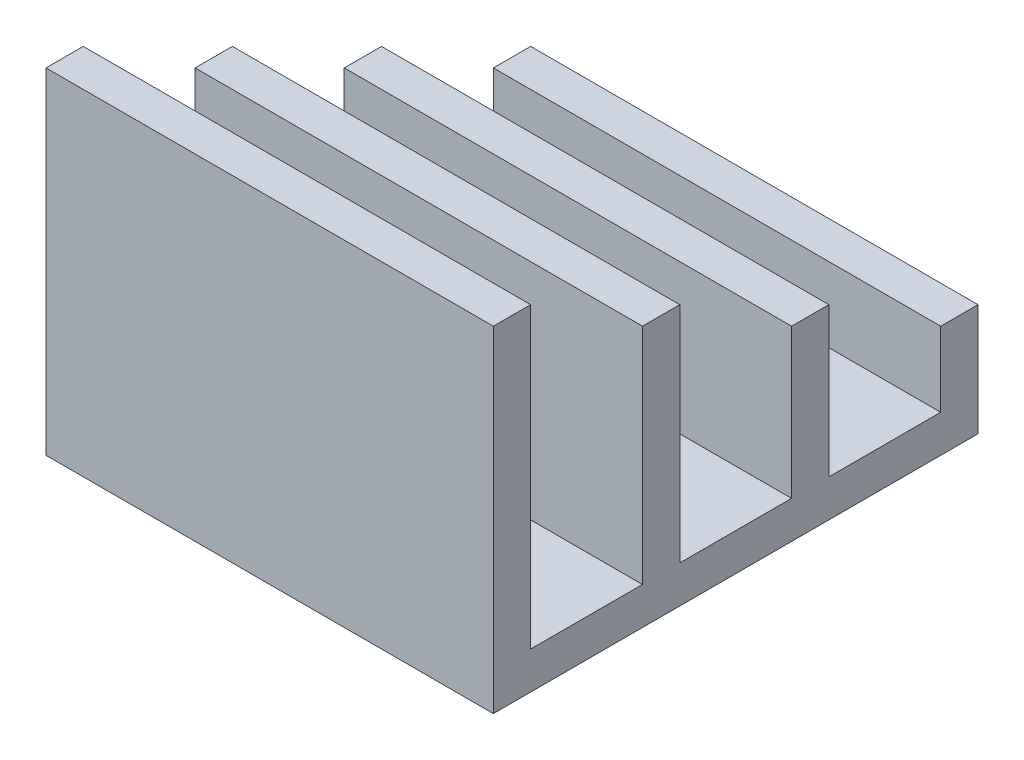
from build123d import *

# Parameters (mm, degrees)
BOSS_EXTRUDE1_DEPTH = 152.4


with BuildPart() as part:
    # Sketch1 → Boss-Extrude1 (new body)
    with BuildSketch(Plane(origin=(0, 0, 0), x_dir=(0, 0, -1), z_dir=(1, 0, 0))):
        Polygon((0, 0), (0, 114.3), (12.7, 114.3), (12.7, 12.7), (50.8, 12.7), (50.8, 88.9), (63.5, 88.9), (63.5, 12.7), (101.6, 12.7), (101.6, 63.5), (114.3, 63.5), (114.3, 12.7), (152.4, 12.7), (152.4, 38.1), (165.1, 38.1), (165.1, 0), align=None)
    extrude(amount=BOSS_EXTRUDE1_DEPTH)


solid = part.part
